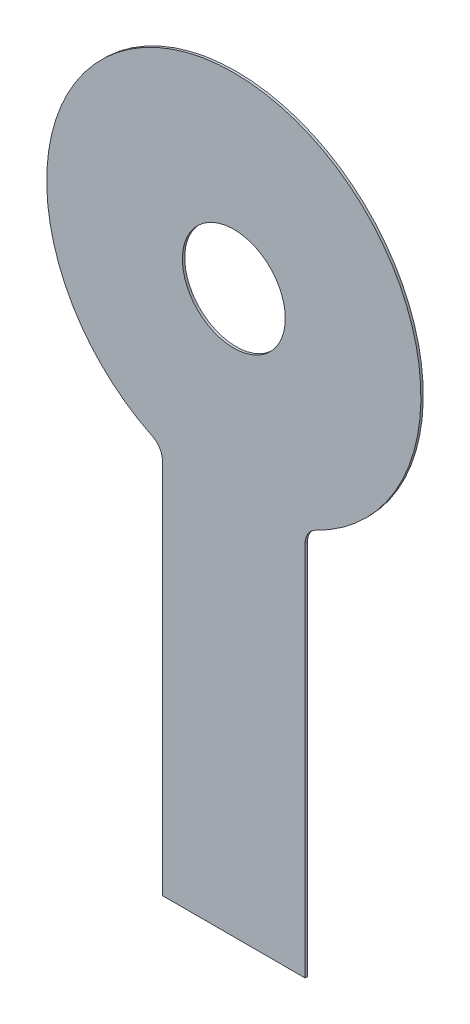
from build123d import *

# Parameters (mm, degrees)
SKETCH1_R           = 2.75
BOSS_EXTRUDE1_DEPTH = 0.127


with BuildPart() as part:
    # Sketch1 → Boss-Extrude1 (new body)
    with BuildSketch(Plane.XY):
        with BuildLine():
            Line((-3.81, -9.89261846), (-3.81, -29.999750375))
            Line((-3.81, -29.999750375), (3.81, -29.999750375))
            Line((3.81, -29.999750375), (3.81, -9.89261846))
            ThreePointArc((3.81, -9.89261846), (3.962275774, -9.362181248), (4.372727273, -8.993289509))
            ThreePointArc((4.372727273, -8.993289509), (0, 10), (-4.372727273, -8.993289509))
            ThreePointArc((-4.372727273, -8.993289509), (-3.962275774, -9.362181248), (-3.81, -9.89261846))
        make_face()
        Circle(SKETCH1_R, mode=Mode.SUBTRACT)
    extrude(amount=BOSS_EXTRUDE1_DEPTH)


solid = part.part
